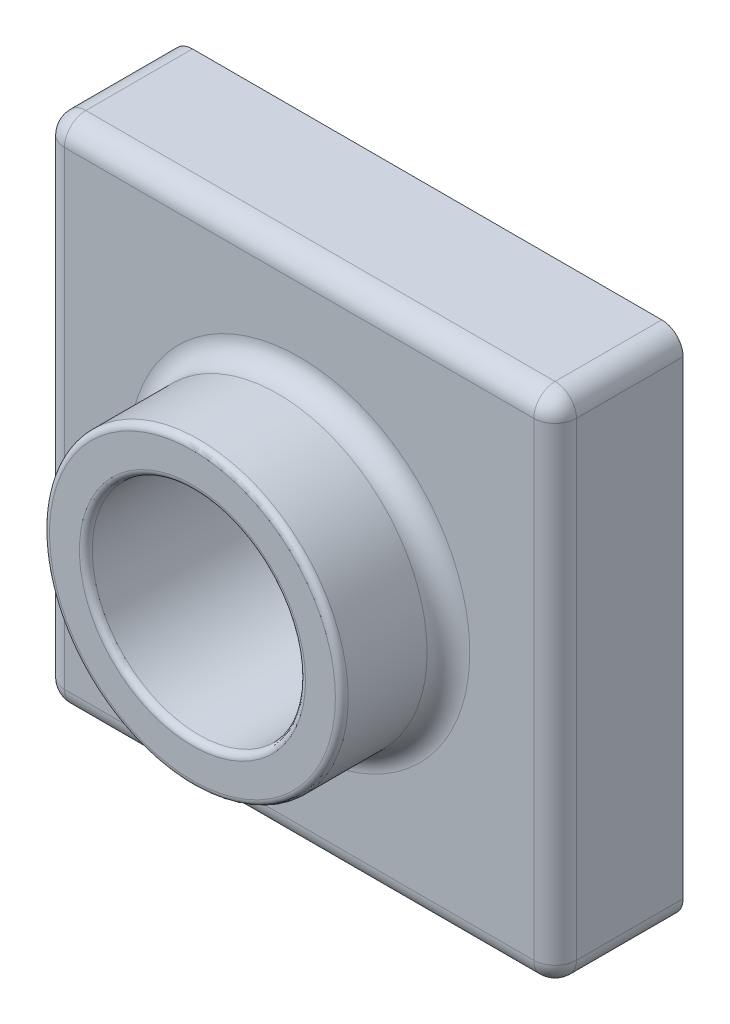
ISO-10303-21;
HEADER;
FILE_DESCRIPTION(('STEP AP214'),'2;1');
FILE_NAME('part.step','',(''),(''),'','','');
FILE_SCHEMA(('AUTOMOTIVE_DESIGN { 1 0 10303 214 1 1 1 1 }'));
ENDSEC;
DATA;
#1=APPLICATION_CONTEXT('core data for automotive mechanical design processes');
#2=APPLICATION_PROTOCOL_DEFINITION('international standard','automotive_design',2000,#1);
#3=PRODUCT_CONTEXT('',#1,'mechanical');
#4=PRODUCT('Part','Part','',(#3));
#5=PRODUCT_RELATED_PRODUCT_CATEGORY('part','',(#4));
#6=PRODUCT_DEFINITION_FORMATION('','',#4);
#7=PRODUCT_DEFINITION_CONTEXT('part definition',#1,'design');
#8=PRODUCT_DEFINITION('design','',#6,#7);
#9=PRODUCT_DEFINITION_SHAPE('','',#8);
#10=(LENGTH_UNIT() NAMED_UNIT(*) SI_UNIT(.MILLI.,.METRE.));
#11=(NAMED_UNIT(*) PLANE_ANGLE_UNIT() SI_UNIT($,.RADIAN.));
#12=(NAMED_UNIT(*) SI_UNIT($,.STERADIAN.) SOLID_ANGLE_UNIT());
#13=UNCERTAINTY_MEASURE_WITH_UNIT(LENGTH_MEASURE(1.E-05),#10,'distance_accuracy_value','');
#14=(GEOMETRIC_REPRESENTATION_CONTEXT(3) GLOBAL_UNCERTAINTY_ASSIGNED_CONTEXT((#13)) GLOBAL_UNIT_ASSIGNED_CONTEXT((#10,
#11,#12)) REPRESENTATION_CONTEXT('',''));
#15=CARTESIAN_POINT('',(0.,0.,0.));
#16=DIRECTION('',(0.,0.,1.));
#17=DIRECTION('',(1.,0.,0.));
#18=AXIS2_PLACEMENT_3D('',#15,#16,#17);
#19=CARTESIAN_POINT('',(0.,120.,30.));
#20=DIRECTION('',(0.,0.,-1.));
#21=DIRECTION('',(-1.,0.,0.));
#22=AXIS2_PLACEMENT_3D('',#19,#20,#21);
#23=PLANE('',#22);
#24=CARTESIAN_POINT('',(60.,60.,30.));
#25=DIRECTION('',(0.,0.,-1.));
#26=DIRECTION('',(-1.,0.,0.));
#27=AXIS2_PLACEMENT_3D('',#24,#25,#26);
#28=CIRCLE('',#27,40.);
#29=CARTESIAN_POINT('',(19.9999999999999,60.,30.));
#30=VERTEX_POINT('',#29);
#31=EDGE_CURVE('E142',#30,#30,#28,.T.);
#32=ORIENTED_EDGE('',*,*,#31,.T.);
#33=EDGE_LOOP('',(#32));
#34=FACE_BOUND('',#33,.T.);
#35=DIRECTION('',(0.,1.,0.));
#36=VECTOR('',#35,1.);
#37=CARTESIAN_POINT('',(115.,120.,30.));
#38=LINE('',#37,#36);
#39=CARTESIAN_POINT('',(115.,5.,30.));
#40=VERTEX_POINT('',#39);
#41=CARTESIAN_POINT('',(115.,115.,30.));
#42=VERTEX_POINT('',#41);
#43=EDGE_CURVE('E140',#40,#42,#38,.T.);
#44=ORIENTED_EDGE('',*,*,#43,.T.);
#45=DIRECTION('',(-1.,0.,0.));
#46=VECTOR('',#45,1.);
#47=CARTESIAN_POINT('',(0.,115.,30.));
#48=LINE('',#47,#46);
#49=CARTESIAN_POINT('',(4.99999999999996,115.,30.));
#50=VERTEX_POINT('',#49);
#51=EDGE_CURVE('E113',#42,#50,#48,.T.);
#52=ORIENTED_EDGE('',*,*,#51,.T.);
#53=DIRECTION('',(0.,-1.,0.));
#54=VECTOR('',#53,1.);
#55=CARTESIAN_POINT('',(4.99999999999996,120.,30.));
#56=LINE('',#55,#54);
#57=CARTESIAN_POINT('',(5.,5.,30.));
#58=VERTEX_POINT('',#57);
#59=EDGE_CURVE('E130',#50,#58,#56,.T.);
#60=ORIENTED_EDGE('',*,*,#59,.T.);
#61=DIRECTION('',(1.,0.,0.));
#62=VECTOR('',#61,1.);
#63=CARTESIAN_POINT('',(0.,5.,30.));
#64=LINE('',#63,#62);
#65=EDGE_CURVE('E136',#58,#40,#64,.T.);
#66=ORIENTED_EDGE('',*,*,#65,.T.);
#67=EDGE_LOOP('',(#44,#52,#60,#66));
#68=FACE_BOUND('',#67,.T.);
#69=ADVANCED_FACE('F31',(#34,#68),#23,.F.);
#70=CARTESIAN_POINT('',(0.,0.,30.));
#71=DIRECTION('',(1.,0.,0.));
#72=DIRECTION('',(0.,1.,0.));
#73=AXIS2_PLACEMENT_3D('',#70,#71,#72);
#74=PLANE('',#73);
#75=DIRECTION('',(0.,-1.,0.));
#76=VECTOR('',#75,1.);
#77=CARTESIAN_POINT('',(0.,0.,0.));
#78=LINE('',#77,#76);
#79=CARTESIAN_POINT('',(0.,115.,0.));
#80=VERTEX_POINT('',#79);
#81=CARTESIAN_POINT('',(0.,5.,0.));
#82=VERTEX_POINT('',#81);
#83=EDGE_CURVE('E236',#80,#82,#78,.T.);
#84=ORIENTED_EDGE('',*,*,#83,.T.);
#85=DIRECTION('',(0.,0.,-1.));
#86=VECTOR('',#85,1.);
#87=CARTESIAN_POINT('',(0.,5.,30.));
#88=LINE('',#87,#86);
#89=CARTESIAN_POINT('',(0.,5.,25.));
#90=VERTEX_POINT('',#89);
#91=EDGE_CURVE('E46',#82,#90,#88,.F.);
#92=ORIENTED_EDGE('',*,*,#91,.T.);
#93=DIRECTION('',(0.,-1.,0.));
#94=VECTOR('',#93,1.);
#95=CARTESIAN_POINT('',(0.,0.,25.));
#96=LINE('',#95,#94);
#97=CARTESIAN_POINT('',(0.,115.,25.));
#98=VERTEX_POINT('',#97);
#99=EDGE_CURVE('E51',#90,#98,#96,.F.);
#100=ORIENTED_EDGE('',*,*,#99,.T.);
#101=DIRECTION('',(0.,0.,-1.));
#102=VECTOR('',#101,1.);
#103=CARTESIAN_POINT('',(0.,115.,30.));
#104=LINE('',#103,#102);
#105=EDGE_CURVE('E166',#98,#80,#104,.T.);
#106=ORIENTED_EDGE('',*,*,#105,.T.);
#107=EDGE_LOOP('',(#84,#92,#100,#106));
#108=FACE_BOUND('',#107,.T.);
#109=ADVANCED_FACE('F279',(#108),#74,.F.);
#110=CARTESIAN_POINT('',(0.,0.,30.));
#111=DIRECTION('',(0.,1.,0.));
#112=DIRECTION('',(0.,0.,1.));
#113=AXIS2_PLACEMENT_3D('',#110,#111,#112);
#114=PLANE('',#113);
#115=DIRECTION('',(1.,0.,0.));
#116=VECTOR('',#115,1.);
#117=CARTESIAN_POINT('',(0.,0.,25.));
#118=LINE('',#117,#116);
#119=CARTESIAN_POINT('',(115.,0.,25.));
#120=VERTEX_POINT('',#119);
#121=CARTESIAN_POINT('',(5.,0.,25.));
#122=VERTEX_POINT('',#121);
#123=EDGE_CURVE('E162',#120,#122,#118,.F.);
#124=ORIENTED_EDGE('',*,*,#123,.T.);
#125=DIRECTION('',(0.,0.,-1.));
#126=VECTOR('',#125,1.);
#127=CARTESIAN_POINT('',(5.,0.,30.));
#128=LINE('',#127,#126);
#129=CARTESIAN_POINT('',(5.,0.,0.));
#130=VERTEX_POINT('',#129);
#131=EDGE_CURVE('E164',#122,#130,#128,.T.);
#132=ORIENTED_EDGE('',*,*,#131,.T.);
#133=DIRECTION('',(1.,0.,0.));
#134=VECTOR('',#133,1.);
#135=CARTESIAN_POINT('',(0.,0.,0.));
#136=LINE('',#135,#134);
#137=CARTESIAN_POINT('',(115.,0.,0.));
#138=VERTEX_POINT('',#137);
#139=EDGE_CURVE('E238',#130,#138,#136,.T.);
#140=ORIENTED_EDGE('',*,*,#139,.T.);
#141=DIRECTION('',(0.,0.,-1.));
#142=VECTOR('',#141,1.);
#143=CARTESIAN_POINT('',(115.,0.,30.));
#144=LINE('',#143,#142);
#145=EDGE_CURVE('E160',#138,#120,#144,.F.);
#146=ORIENTED_EDGE('',*,*,#145,.T.);
#147=EDGE_LOOP('',(#124,#132,#140,#146));
#148=FACE_BOUND('',#147,.T.);
#149=ADVANCED_FACE('F303',(#148),#114,.F.);
#150=CARTESIAN_POINT('',(120.,0.,30.));
#151=DIRECTION('',(-1.,0.,0.));
#152=DIRECTION('',(0.,-1.,0.));
#153=AXIS2_PLACEMENT_3D('',#150,#151,#152);
#154=PLANE('',#153);
#155=DIRECTION('',(0.,1.,0.));
#156=VECTOR('',#155,1.);
#157=CARTESIAN_POINT('',(120.,0.,25.));
#158=LINE('',#157,#156);
#159=CARTESIAN_POINT('',(120.,115.,25.));
#160=VERTEX_POINT('',#159);
#161=CARTESIAN_POINT('',(120.,5.,25.));
#162=VERTEX_POINT('',#161);
#163=EDGE_CURVE('E156',#160,#162,#158,.F.);
#164=ORIENTED_EDGE('',*,*,#163,.T.);
#165=DIRECTION('',(0.,0.,-1.));
#166=VECTOR('',#165,1.);
#167=CARTESIAN_POINT('',(120.,5.,30.));
#168=LINE('',#167,#166);
#169=CARTESIAN_POINT('',(120.,5.,0.));
#170=VERTEX_POINT('',#169);
#171=EDGE_CURVE('E158',#162,#170,#168,.T.);
#172=ORIENTED_EDGE('',*,*,#171,.T.);
#173=DIRECTION('',(0.,1.,0.));
#174=VECTOR('',#173,1.);
#175=CARTESIAN_POINT('',(120.,0.,0.));
#176=LINE('',#175,#174);
#177=CARTESIAN_POINT('',(120.,115.,0.));
#178=VERTEX_POINT('',#177);
#179=EDGE_CURVE('E243',#170,#178,#176,.T.);
#180=ORIENTED_EDGE('',*,*,#179,.T.);
#181=DIRECTION('',(0.,0.,-1.));
#182=VECTOR('',#181,1.);
#183=CARTESIAN_POINT('',(120.,115.,30.));
#184=LINE('',#183,#182);
#185=EDGE_CURVE('E154',#178,#160,#184,.F.);
#186=ORIENTED_EDGE('',*,*,#185,.T.);
#187=EDGE_LOOP('',(#164,#172,#180,#186));
#188=FACE_BOUND('',#187,.T.);
#189=ADVANCED_FACE('F311',(#188),#154,.F.);
#190=CARTESIAN_POINT('',(0.,120.,30.));
#191=DIRECTION('',(0.,-1.,0.));
#192=DIRECTION('',(0.,0.,-1.));
#193=AXIS2_PLACEMENT_3D('',#190,#191,#192);
#194=PLANE('',#193);
#195=DIRECTION('',(-1.,0.,0.));
#196=VECTOR('',#195,1.);
#197=CARTESIAN_POINT('',(0.,120.,25.));
#198=LINE('',#197,#196);
#199=CARTESIAN_POINT('',(4.99999999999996,120.,25.));
#200=VERTEX_POINT('',#199);
#201=CARTESIAN_POINT('',(115.,120.,25.));
#202=VERTEX_POINT('',#201);
#203=EDGE_CURVE('E115',#200,#202,#198,.F.);
#204=ORIENTED_EDGE('',*,*,#203,.T.);
#205=DIRECTION('',(0.,0.,-1.));
#206=VECTOR('',#205,1.);
#207=CARTESIAN_POINT('',(115.,120.,30.));
#208=LINE('',#207,#206);
#209=CARTESIAN_POINT('',(115.,120.,0.));
#210=VERTEX_POINT('',#209);
#211=EDGE_CURVE('E152',#202,#210,#208,.T.);
#212=ORIENTED_EDGE('',*,*,#211,.T.);
#213=DIRECTION('',(-1.,0.,0.));
#214=VECTOR('',#213,1.);
#215=CARTESIAN_POINT('',(0.,120.,0.));
#216=LINE('',#215,#214);
#217=CARTESIAN_POINT('',(4.99999999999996,120.,0.));
#218=VERTEX_POINT('',#217);
#219=EDGE_CURVE('E246',#210,#218,#216,.T.);
#220=ORIENTED_EDGE('',*,*,#219,.T.);
#221=DIRECTION('',(0.,0.,-1.));
#222=VECTOR('',#221,1.);
#223=CARTESIAN_POINT('',(4.99999999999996,120.,30.));
#224=LINE('',#223,#222);
#225=EDGE_CURVE('E145',#218,#200,#224,.F.);
#226=ORIENTED_EDGE('',*,*,#225,.T.);
#227=EDGE_LOOP('',(#204,#212,#220,#226));
#228=FACE_BOUND('',#227,.T.);
#229=ADVANCED_FACE('F273',(#228),#194,.F.);
#230=CARTESIAN_POINT('',(0.,120.,0.));
#231=DIRECTION('',(0.,0.,-1.));
#232=DIRECTION('',(-1.,0.,0.));
#233=AXIS2_PLACEMENT_3D('',#230,#231,#232);
#234=PLANE('',#233);
#235=CARTESIAN_POINT('',(60.,60.,0.));
#236=DIRECTION('',(0.,0.,1.));
#237=DIRECTION('',(1.,0.,0.));
#238=AXIS2_PLACEMENT_3D('',#235,#236,#237);
#239=CIRCLE('',#238,25.);
#240=CARTESIAN_POINT('',(85.,60.,0.));
#241=VERTEX_POINT('',#240);
#242=EDGE_CURVE('E202',#241,#241,#239,.T.);
#243=ORIENTED_EDGE('',*,*,#242,.T.);
#244=EDGE_LOOP('',(#243));
#245=FACE_BOUND('',#244,.T.);
#246=ORIENTED_EDGE('',*,*,#139,.F.);
#247=CARTESIAN_POINT('',(5.,5.,0.));
#248=DIRECTION('',(0.,0.,-1.));
#249=DIRECTION('',(-1.,0.,0.));
#250=AXIS2_PLACEMENT_3D('',#247,#248,#249);
#251=CIRCLE('',#250,5.);
#252=EDGE_CURVE('E176',#130,#82,#251,.T.);
#253=ORIENTED_EDGE('',*,*,#252,.T.);
#254=ORIENTED_EDGE('',*,*,#83,.F.);
#255=CARTESIAN_POINT('',(4.99999999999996,115.,0.));
#256=DIRECTION('',(0.,0.,-1.));
#257=DIRECTION('',(-1.,0.,0.));
#258=AXIS2_PLACEMENT_3D('',#255,#256,#257);
#259=CIRCLE('',#258,5.);
#260=EDGE_CURVE('E170',#80,#218,#259,.T.);
#261=ORIENTED_EDGE('',*,*,#260,.T.);
#262=ORIENTED_EDGE('',*,*,#219,.F.);
#263=CARTESIAN_POINT('',(115.,115.,0.));
#264=DIRECTION('',(0.,0.,-1.));
#265=DIRECTION('',(-1.,0.,0.));
#266=AXIS2_PLACEMENT_3D('',#263,#264,#265);
#267=CIRCLE('',#266,5.);
#268=EDGE_CURVE('E172',#210,#178,#267,.T.);
#269=ORIENTED_EDGE('',*,*,#268,.T.);
#270=ORIENTED_EDGE('',*,*,#179,.F.);
#271=CARTESIAN_POINT('',(115.,5.,0.));
#272=DIRECTION('',(0.,0.,-1.));
#273=DIRECTION('',(-1.,0.,0.));
#274=AXIS2_PLACEMENT_3D('',#271,#272,#273);
#275=CIRCLE('',#274,5.);
#276=EDGE_CURVE('E174',#170,#138,#275,.T.);
#277=ORIENTED_EDGE('',*,*,#276,.T.);
#278=EDGE_LOOP('',(#246,#253,#254,#261,#262,#269,#270,#277));
#279=FACE_BOUND('',#278,.T.);
#280=ADVANCED_FACE('F282',(#245,#279),#234,.T.);
#281=CARTESIAN_POINT('',(60.,60.,55.));
#282=DIRECTION('',(0.,0.,-1.));
#283=DIRECTION('',(-1.,0.,0.));
#284=AXIS2_PLACEMENT_3D('',#281,#282,#283);
#285=CYLINDRICAL_SURFACE('',#284,35.);
#286=CARTESIAN_POINT('',(60.,60.,53.5));
#287=DIRECTION('',(0.,0.,1.));
#288=DIRECTION('',(1.,0.,0.));
#289=AXIS2_PLACEMENT_3D('',#286,#287,#288);
#290=CIRCLE('',#289,35.);
#291=CARTESIAN_POINT('',(95.,60.,53.5));
#292=VERTEX_POINT('',#291);
#293=EDGE_CURVE('E39',#292,#292,#290,.F.);
#294=ORIENTED_EDGE('',*,*,#293,.T.);
#295=EDGE_LOOP('',(#294));
#296=FACE_BOUND('',#295,.T.);
#297=CARTESIAN_POINT('',(60.,60.,35.));
#298=DIRECTION('',(0.,0.,-1.));
#299=DIRECTION('',(-1.,0.,0.));
#300=AXIS2_PLACEMENT_3D('',#297,#298,#299);
#301=CIRCLE('',#300,35.);
#302=CARTESIAN_POINT('',(24.9999999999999,60.,35.));
#303=VERTEX_POINT('',#302);
#304=EDGE_CURVE('E137',#303,#303,#301,.F.);
#305=ORIENTED_EDGE('',*,*,#304,.T.);
#306=EDGE_LOOP('',(#305));
#307=FACE_BOUND('',#306,.T.);
#308=ADVANCED_FACE('F210',(#296,#307),#285,.T.);
#309=CARTESIAN_POINT('',(60.,60.,55.));
#310=DIRECTION('',(0.,0.,1.));
#311=DIRECTION('',(1.,0.,0.));
#312=AXIS2_PLACEMENT_3D('',#309,#310,#311);
#313=PLANE('',#312);
#314=CARTESIAN_POINT('',(60.,60.,55.));
#315=DIRECTION('',(0.,0.,1.));
#316=DIRECTION('',(1.,0.,0.));
#317=AXIS2_PLACEMENT_3D('',#314,#315,#316);
#318=CIRCLE('',#317,33.5);
#319=CARTESIAN_POINT('',(93.5,60.,55.));
#320=VERTEX_POINT('',#319);
#321=EDGE_CURVE('E205',#320,#320,#318,.T.);
#322=ORIENTED_EDGE('',*,*,#321,.T.);
#323=EDGE_LOOP('',(#322));
#324=FACE_BOUND('',#323,.T.);
#325=CARTESIAN_POINT('',(60.,60.,55.));
#326=DIRECTION('',(0.,0.,1.));
#327=DIRECTION('',(1.,0.,0.));
#328=AXIS2_PLACEMENT_3D('',#325,#326,#327);
#329=CIRCLE('',#328,26.5);
#330=CARTESIAN_POINT('',(86.5,60.,55.));
#331=VERTEX_POINT('',#330);
#332=EDGE_CURVE('E177',#331,#331,#329,.F.);
#333=ORIENTED_EDGE('',*,*,#332,.T.);
#334=EDGE_LOOP('',(#333));
#335=FACE_BOUND('',#334,.T.);
#336=ADVANCED_FACE('F218',(#324,#335),#313,.T.);
#337=CARTESIAN_POINT('',(60.,60.,0.));
#338=DIRECTION('',(0.,0.,1.));
#339=DIRECTION('',(1.,0.,0.));
#340=AXIS2_PLACEMENT_3D('',#337,#338,#339);
#341=CYLINDRICAL_SURFACE('',#340,25.);
#342=CARTESIAN_POINT('',(60.,60.,53.5));
#343=DIRECTION('',(0.,0.,1.));
#344=DIRECTION('',(1.,0.,0.));
#345=AXIS2_PLACEMENT_3D('',#342,#343,#344);
#346=CIRCLE('',#345,25.);
#347=CARTESIAN_POINT('',(85.,60.,53.5));
#348=VERTEX_POINT('',#347);
#349=EDGE_CURVE('E11',#348,#348,#346,.T.);
#350=ORIENTED_EDGE('',*,*,#349,.T.);
#351=EDGE_LOOP('',(#350));
#352=FACE_BOUND('',#351,.T.);
#353=ORIENTED_EDGE('',*,*,#242,.F.);
#354=EDGE_LOOP('',(#353));
#355=FACE_BOUND('',#354,.T.);
#356=ADVANCED_FACE('F221',(#352,#355),#341,.F.);
#357=CARTESIAN_POINT('',(60.,60.,35.));
#358=DIRECTION('',(0.,0.,-1.));
#359=DIRECTION('',(-1.,0.,0.));
#360=AXIS2_PLACEMENT_3D('',#357,#358,#359);
#361=TOROIDAL_SURFACE('',#360,40.,5.);
#362=ORIENTED_EDGE('',*,*,#31,.F.);
#363=EDGE_LOOP('',(#362));
#364=FACE_BOUND('',#363,.T.);
#365=ORIENTED_EDGE('',*,*,#304,.F.);
#366=EDGE_LOOP('',(#365));
#367=FACE_BOUND('',#366,.T.);
#368=ADVANCED_FACE('F231',(#364,#367),#361,.F.);
#369=CARTESIAN_POINT('',(115.,5.,30.));
#370=DIRECTION('',(0.,0.,-1.));
#371=DIRECTION('',(-1.,0.,0.));
#372=AXIS2_PLACEMENT_3D('',#369,#370,#371);
#373=CYLINDRICAL_SURFACE('',#372,5.);
#374=ORIENTED_EDGE('',*,*,#276,.F.);
#375=ORIENTED_EDGE('',*,*,#171,.F.);
#376=CARTESIAN_POINT('',(115.,5.,25.));
#377=DIRECTION('',(0.,0.,1.));
#378=DIRECTION('',(1.,0.,0.));
#379=AXIS2_PLACEMENT_3D('',#376,#377,#378);
#380=CIRCLE('',#379,5.);
#381=EDGE_CURVE('E199',#120,#162,#380,.T.);
#382=ORIENTED_EDGE('',*,*,#381,.F.);
#383=ORIENTED_EDGE('',*,*,#145,.F.);
#384=EDGE_LOOP('',(#374,#375,#382,#383));
#385=FACE_BOUND('',#384,.T.);
#386=ADVANCED_FACE('F320',(#385),#373,.T.);
#387=CARTESIAN_POINT('',(0.,5.,25.));
#388=DIRECTION('',(1.,0.,0.));
#389=DIRECTION('',(0.,0.,-1.));
#390=AXIS2_PLACEMENT_3D('',#387,#388,#389);
#391=CYLINDRICAL_SURFACE('',#390,5.);
#392=CARTESIAN_POINT('',(5.,5.,25.));
#393=DIRECTION('',(-1.,0.,0.));
#394=DIRECTION('',(0.,0.,1.));
#395=AXIS2_PLACEMENT_3D('',#392,#393,#394);
#396=CIRCLE('',#395,5.);
#397=EDGE_CURVE('E193',#122,#58,#396,.T.);
#398=ORIENTED_EDGE('',*,*,#397,.F.);
#399=ORIENTED_EDGE('',*,*,#123,.F.);
#400=CARTESIAN_POINT('',(115.,5.,25.));
#401=DIRECTION('',(1.,0.,0.));
#402=DIRECTION('',(0.,0.,-1.));
#403=AXIS2_PLACEMENT_3D('',#400,#401,#402);
#404=CIRCLE('',#403,5.);
#405=EDGE_CURVE('E196',#40,#120,#404,.T.);
#406=ORIENTED_EDGE('',*,*,#405,.F.);
#407=ORIENTED_EDGE('',*,*,#65,.F.);
#408=EDGE_LOOP('',(#398,#399,#406,#407));
#409=FACE_BOUND('',#408,.T.);
#410=ADVANCED_FACE('F255',(#409),#391,.T.);
#411=CARTESIAN_POINT('',(5.,5.,30.));
#412=DIRECTION('',(0.,0.,-1.));
#413=DIRECTION('',(-1.,0.,0.));
#414=AXIS2_PLACEMENT_3D('',#411,#412,#413);
#415=CYLINDRICAL_SURFACE('',#414,5.);
#416=ORIENTED_EDGE('',*,*,#252,.F.);
#417=ORIENTED_EDGE('',*,*,#131,.F.);
#418=CARTESIAN_POINT('',(5.,5.,25.));
#419=DIRECTION('',(0.,0.,1.));
#420=DIRECTION('',(1.,0.,0.));
#421=AXIS2_PLACEMENT_3D('',#418,#419,#420);
#422=CIRCLE('',#421,5.);
#423=EDGE_CURVE('E190',#90,#122,#422,.T.);
#424=ORIENTED_EDGE('',*,*,#423,.F.);
#425=ORIENTED_EDGE('',*,*,#91,.F.);
#426=EDGE_LOOP('',(#416,#417,#424,#425));
#427=FACE_BOUND('',#426,.T.);
#428=ADVANCED_FACE('F286',(#427),#415,.T.);
#429=CARTESIAN_POINT('',(115.,5.,25.));
#430=DIRECTION('',(0.,0.,1.));
#431=DIRECTION('',(1.,0.,0.));
#432=AXIS2_PLACEMENT_3D('',#429,#430,#431);
#433=SPHERICAL_SURFACE('',#432,5.);
#434=ORIENTED_EDGE('',*,*,#405,.T.);
#435=ORIENTED_EDGE('',*,*,#381,.T.);
#436=CARTESIAN_POINT('',(115.,5.,25.));
#437=DIRECTION('',(0.,-1.,0.));
#438=DIRECTION('',(0.,0.,-1.));
#439=AXIS2_PLACEMENT_3D('',#436,#437,#438);
#440=CIRCLE('',#439,5.);
#441=EDGE_CURVE('E187',#40,#162,#440,.F.);
#442=ORIENTED_EDGE('',*,*,#441,.F.);
#443=EDGE_LOOP('',(#434,#435,#442));
#444=FACE_BOUND('',#443,.T.);
#445=ADVANCED_FACE('F258',(#444),#433,.T.);
#446=CARTESIAN_POINT('',(5.,5.,25.));
#447=DIRECTION('',(0.,0.,1.));
#448=DIRECTION('',(1.,0.,0.));
#449=AXIS2_PLACEMENT_3D('',#446,#447,#448);
#450=SPHERICAL_SURFACE('',#449,5.);
#451=ORIENTED_EDGE('',*,*,#423,.T.);
#452=ORIENTED_EDGE('',*,*,#397,.T.);
#453=CARTESIAN_POINT('',(5.,5.,25.));
#454=DIRECTION('',(0.,-1.,0.));
#455=DIRECTION('',(1.,0.,0.));
#456=AXIS2_PLACEMENT_3D('',#453,#454,#455);
#457=CIRCLE('',#456,5.);
#458=EDGE_CURVE('E133',#90,#58,#457,.F.);
#459=ORIENTED_EDGE('',*,*,#458,.F.);
#460=EDGE_LOOP('',(#451,#452,#459));
#461=FACE_BOUND('',#460,.T.);
#462=ADVANCED_FACE('F288',(#461),#450,.T.);
#463=CARTESIAN_POINT('',(115.,115.,30.));
#464=DIRECTION('',(0.,0.,-1.));
#465=DIRECTION('',(-1.,0.,0.));
#466=AXIS2_PLACEMENT_3D('',#463,#464,#465);
#467=CYLINDRICAL_SURFACE('',#466,5.);
#468=ORIENTED_EDGE('',*,*,#268,.F.);
#469=ORIENTED_EDGE('',*,*,#211,.F.);
#470=CARTESIAN_POINT('',(115.,115.,25.));
#471=DIRECTION('',(0.,0.,1.));
#472=DIRECTION('',(1.,0.,0.));
#473=AXIS2_PLACEMENT_3D('',#470,#471,#472);
#474=CIRCLE('',#473,5.);
#475=EDGE_CURVE('E183',#160,#202,#474,.T.);
#476=ORIENTED_EDGE('',*,*,#475,.F.);
#477=ORIENTED_EDGE('',*,*,#185,.F.);
#478=EDGE_LOOP('',(#468,#469,#476,#477));
#479=FACE_BOUND('',#478,.T.);
#480=ADVANCED_FACE('F270',(#479),#467,.T.);
#481=CARTESIAN_POINT('',(115.,120.,25.));
#482=DIRECTION('',(0.,1.,0.));
#483=DIRECTION('',(-1.,0.,0.));
#484=AXIS2_PLACEMENT_3D('',#481,#482,#483);
#485=CYLINDRICAL_SURFACE('',#484,5.);
#486=ORIENTED_EDGE('',*,*,#441,.T.);
#487=ORIENTED_EDGE('',*,*,#163,.F.);
#488=CARTESIAN_POINT('',(115.,115.,25.));
#489=DIRECTION('',(0.,1.,0.));
#490=DIRECTION('',(0.,0.,1.));
#491=AXIS2_PLACEMENT_3D('',#488,#489,#490);
#492=CIRCLE('',#491,5.);
#493=EDGE_CURVE('E127',#42,#160,#492,.T.);
#494=ORIENTED_EDGE('',*,*,#493,.F.);
#495=ORIENTED_EDGE('',*,*,#43,.F.);
#496=EDGE_LOOP('',(#486,#487,#494,#495));
#497=FACE_BOUND('',#496,.T.);
#498=ADVANCED_FACE('F261',(#497),#485,.T.);
#499=CARTESIAN_POINT('',(4.99999999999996,120.,25.));
#500=DIRECTION('',(0.,-1.,0.));
#501=DIRECTION('',(1.,0.,0.));
#502=AXIS2_PLACEMENT_3D('',#499,#500,#501);
#503=CYLINDRICAL_SURFACE('',#502,5.);
#504=ORIENTED_EDGE('',*,*,#458,.T.);
#505=ORIENTED_EDGE('',*,*,#59,.F.);
#506=CARTESIAN_POINT('',(4.99999999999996,115.,25.));
#507=DIRECTION('',(0.,1.,0.));
#508=DIRECTION('',(0.,0.,1.));
#509=AXIS2_PLACEMENT_3D('',#506,#507,#508);
#510=CIRCLE('',#509,5.);
#511=EDGE_CURVE('E121',#98,#50,#510,.T.);
#512=ORIENTED_EDGE('',*,*,#511,.F.);
#513=ORIENTED_EDGE('',*,*,#99,.F.);
#514=EDGE_LOOP('',(#504,#505,#512,#513));
#515=FACE_BOUND('',#514,.T.);
#516=ADVANCED_FACE('F131',(#515),#503,.T.);
#517=CARTESIAN_POINT('',(4.99999999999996,115.,30.));
#518=DIRECTION('',(0.,0.,-1.));
#519=DIRECTION('',(-1.,0.,0.));
#520=AXIS2_PLACEMENT_3D('',#517,#518,#519);
#521=CYLINDRICAL_SURFACE('',#520,5.);
#522=ORIENTED_EDGE('',*,*,#260,.F.);
#523=ORIENTED_EDGE('',*,*,#105,.F.);
#524=CARTESIAN_POINT('',(4.99999999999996,115.,25.));
#525=DIRECTION('',(0.,0.,1.));
#526=DIRECTION('',(1.,0.,0.));
#527=AXIS2_PLACEMENT_3D('',#524,#525,#526);
#528=CIRCLE('',#527,5.);
#529=EDGE_CURVE('E125',#200,#98,#528,.T.);
#530=ORIENTED_EDGE('',*,*,#529,.F.);
#531=ORIENTED_EDGE('',*,*,#225,.F.);
#532=EDGE_LOOP('',(#522,#523,#530,#531));
#533=FACE_BOUND('',#532,.T.);
#534=ADVANCED_FACE('F277',(#533),#521,.T.);
#535=CARTESIAN_POINT('',(115.,115.,25.));
#536=DIRECTION('',(0.,0.,1.));
#537=DIRECTION('',(1.,0.,0.));
#538=AXIS2_PLACEMENT_3D('',#535,#536,#537);
#539=SPHERICAL_SURFACE('',#538,5.);
#540=ORIENTED_EDGE('',*,*,#493,.T.);
#541=ORIENTED_EDGE('',*,*,#475,.T.);
#542=CARTESIAN_POINT('',(115.,115.,25.));
#543=DIRECTION('',(1.,0.,0.));
#544=DIRECTION('',(0.,0.,-1.));
#545=AXIS2_PLACEMENT_3D('',#542,#543,#544);
#546=CIRCLE('',#545,5.);
#547=EDGE_CURVE('E118',#42,#202,#546,.F.);
#548=ORIENTED_EDGE('',*,*,#547,.F.);
#549=EDGE_LOOP('',(#540,#541,#548));
#550=FACE_BOUND('',#549,.T.);
#551=ADVANCED_FACE('F265',(#550),#539,.T.);
#552=CARTESIAN_POINT('',(4.99999999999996,115.,25.));
#553=DIRECTION('',(0.,0.,1.));
#554=DIRECTION('',(1.,0.,0.));
#555=AXIS2_PLACEMENT_3D('',#552,#553,#554);
#556=SPHERICAL_SURFACE('',#555,5.);
#557=ORIENTED_EDGE('',*,*,#529,.T.);
#558=ORIENTED_EDGE('',*,*,#511,.T.);
#559=CARTESIAN_POINT('',(4.99999999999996,115.,25.));
#560=DIRECTION('',(-1.,0.,0.));
#561=DIRECTION('',(0.,0.,1.));
#562=AXIS2_PLACEMENT_3D('',#559,#560,#561);
#563=CIRCLE('',#562,5.);
#564=EDGE_CURVE('E109',#200,#50,#563,.F.);
#565=ORIENTED_EDGE('',*,*,#564,.F.);
#566=EDGE_LOOP('',(#557,#558,#565));
#567=FACE_BOUND('',#566,.T.);
#568=ADVANCED_FACE('F123',(#567),#556,.T.);
#569=CARTESIAN_POINT('',(0.,115.,25.));
#570=DIRECTION('',(-1.,0.,0.));
#571=DIRECTION('',(0.,0.,1.));
#572=AXIS2_PLACEMENT_3D('',#569,#570,#571);
#573=CYLINDRICAL_SURFACE('',#572,5.);
#574=ORIENTED_EDGE('',*,*,#547,.T.);
#575=ORIENTED_EDGE('',*,*,#203,.F.);
#576=ORIENTED_EDGE('',*,*,#564,.T.);
#577=ORIENTED_EDGE('',*,*,#51,.F.);
#578=EDGE_LOOP('',(#574,#575,#576,#577));
#579=FACE_BOUND('',#578,.T.);
#580=ADVANCED_FACE('F111',(#579),#573,.T.);
#581=CARTESIAN_POINT('',(60.,60.,53.5));
#582=DIRECTION('',(0.,0.,1.));
#583=DIRECTION('',(1.,0.,0.));
#584=AXIS2_PLACEMENT_3D('',#581,#582,#583);
#585=TOROIDAL_SURFACE('',#584,33.5,1.5);
#586=ORIENTED_EDGE('',*,*,#293,.F.);
#587=EDGE_LOOP('',(#586));
#588=FACE_BOUND('',#587,.T.);
#589=ORIENTED_EDGE('',*,*,#321,.F.);
#590=EDGE_LOOP('',(#589));
#591=FACE_BOUND('',#590,.T.);
#592=ADVANCED_FACE('F213',(#588,#591),#585,.T.);
#593=CARTESIAN_POINT('',(60.,60.,53.5));
#594=DIRECTION('',(0.,0.,1.));
#595=DIRECTION('',(1.,0.,0.));
#596=AXIS2_PLACEMENT_3D('',#593,#594,#595);
#597=TOROIDAL_SURFACE('',#596,26.5,1.5);
#598=ORIENTED_EDGE('',*,*,#332,.F.);
#599=EDGE_LOOP('',(#598));
#600=FACE_BOUND('',#599,.T.);
#601=ORIENTED_EDGE('',*,*,#349,.F.);
#602=EDGE_LOOP('',(#601));
#603=FACE_BOUND('',#602,.T.);
#604=ADVANCED_FACE('F33',(#600,#603),#597,.T.);
#605=CLOSED_SHELL('',(#69,#109,#149,#189,#229,#280,#308,#336,#356,#368,#386,#410,#428,#445,#462,
#480,#498,#516,#534,#551,#568,#580,#592,#604));
#606=MANIFOLD_SOLID_BREP('B2',#605);
#607=ADVANCED_BREP_SHAPE_REPRESENTATION('',(#18,#606),#14);
#608=SHAPE_DEFINITION_REPRESENTATION(#9,#607);
ENDSEC;
END-ISO-10303-21;
